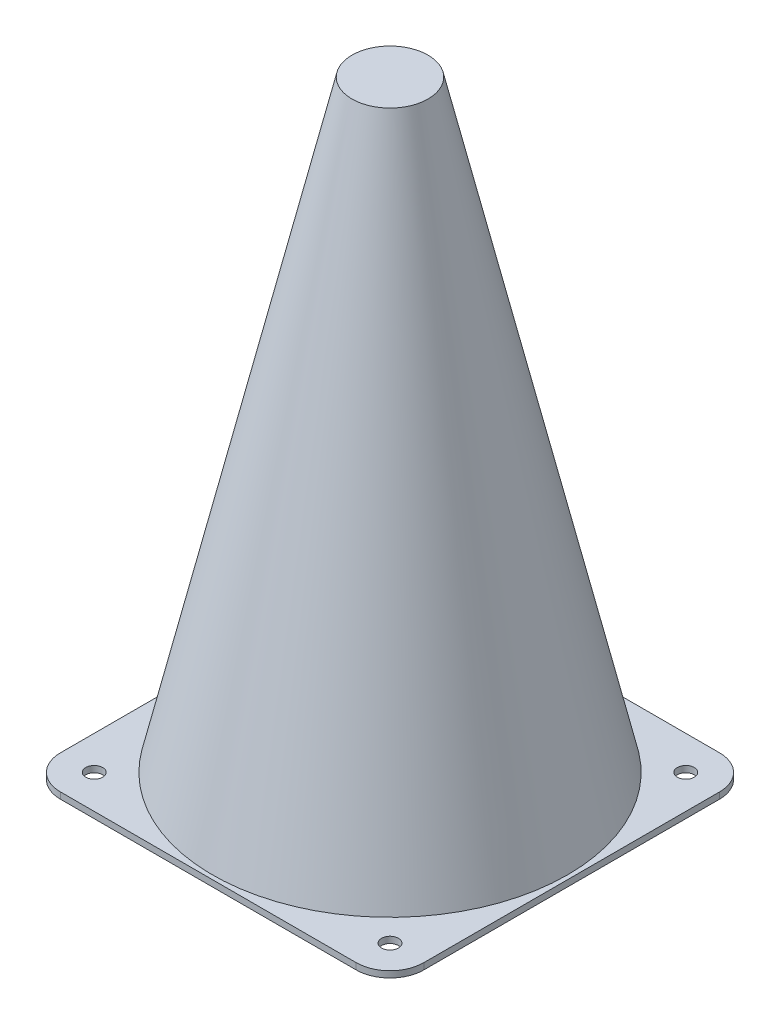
from build123d import *

# Parameters (mm, degrees)
SKETCH1_R      = 65.0875
SKETCH1_R_2    = 3.175
EXTRUDE1_DEPTH = 2.38125


with BuildPart() as part:
    # Sketch1 → Extrude1 (new body)
    with BuildSketch(Plane(origin=(0, 0, 0), x_dir=(1, 0, 0), z_dir=(0, 1, 0))):
        with BuildLine():
            Line((-55.5625, 68.2625), (55.5625, 68.2625))
            ThreePointArc((55.5625, 68.2625), (64.542756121, 64.542756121), (68.2625, 55.5625))
            Line((68.2625, 55.5625), (68.2625, -55.5625))
            ThreePointArc((68.2625, -55.5625), (64.542756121, -64.542756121), (55.5625, -68.2625))
            Line((55.5625, -68.2625), (-55.5625, -68.2625))
            ThreePointArc((-55.5625, -68.2625), (-64.542756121, -64.542756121), (-68.2625, -55.5625))
            Line((-68.2625, -55.5625), (-68.2625, 55.5625))
            ThreePointArc((-68.2625, 55.5625), (-64.542756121, 64.542756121), (-55.5625, 68.2625))
        make_face()
        with Locations(Location((0, 0, 0), (0, 0, 90))):
            Circle(SKETCH1_R, mode=Mode.SUBTRACT)
        with Locations(Location((55.5625, 55.5625, 0), (0, 0, 90))):
            Circle(SKETCH1_R_2, mode=Mode.SUBTRACT)
        with Locations(Location((-55.5625, 55.5625, 0), (0, 0, 90))):
            Circle(SKETCH1_R_2, mode=Mode.SUBTRACT)
        with Locations(Location((-55.5625, -55.5625, 0), (0, 0, 90))):
            Circle(SKETCH1_R_2, mode=Mode.SUBTRACT)
        with Locations(Location((55.5625, -55.5625, 0), (0, 0, 90))):
            Circle(SKETCH1_R_2, mode=Mode.SUBTRACT)
    extrude(amount=EXTRUDE1_DEPTH)

    # Sketch3 → Revolve1 (revolve)
    with BuildSketch(Plane.XY, mode=Mode.PRIVATE) as revolve1_sk:
        Polygon((14.2875, 228.6), (66.717078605, 2.38125), (65.0875, 2.38125), (13.209811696, 226.21875), (0, 226.21875), (0, 228.6), align=None)
    revolve(revolve1_sk.sketch.rotate(Axis((0, 228.6, 0), (0, -1, 0)), 270), axis=Axis((0, 228.6, 0), (0, -1, 0)))


solid = part.part
